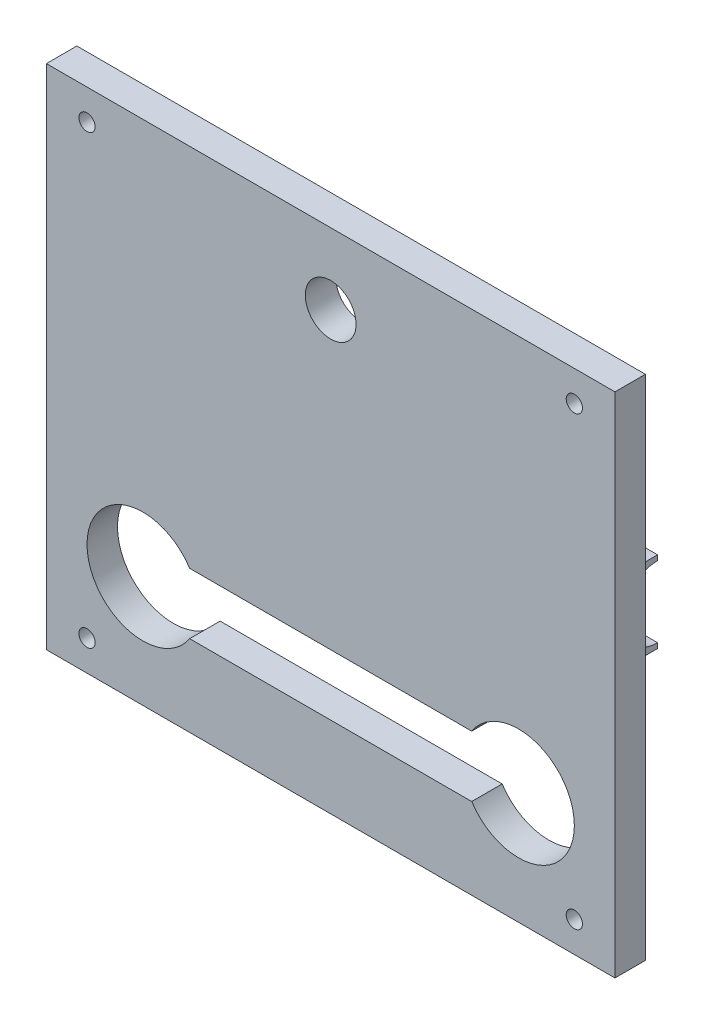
ISO-10303-21;
HEADER;
FILE_DESCRIPTION(('STEP AP214'),'2;1');
FILE_NAME('part.step','',(''),(''),'','','');
FILE_SCHEMA(('AUTOMOTIVE_DESIGN { 1 0 10303 214 1 1 1 1 }'));
ENDSEC;
DATA;
#1=APPLICATION_CONTEXT('core data for automotive mechanical design processes');
#2=APPLICATION_PROTOCOL_DEFINITION('international standard','automotive_design',2000,#1);
#3=PRODUCT_CONTEXT('',#1,'mechanical');
#4=PRODUCT('Part','Part','',(#3));
#5=PRODUCT_RELATED_PRODUCT_CATEGORY('part','',(#4));
#6=PRODUCT_DEFINITION_FORMATION('','',#4);
#7=PRODUCT_DEFINITION_CONTEXT('part definition',#1,'design');
#8=PRODUCT_DEFINITION('design','',#6,#7);
#9=PRODUCT_DEFINITION_SHAPE('','',#8);
#10=(LENGTH_UNIT() NAMED_UNIT(*) SI_UNIT(.MILLI.,.METRE.));
#11=(NAMED_UNIT(*) PLANE_ANGLE_UNIT() SI_UNIT($,.RADIAN.));
#12=(NAMED_UNIT(*) SI_UNIT($,.STERADIAN.) SOLID_ANGLE_UNIT());
#13=UNCERTAINTY_MEASURE_WITH_UNIT(LENGTH_MEASURE(1.E-05),#10,'distance_accuracy_value','');
#14=(GEOMETRIC_REPRESENTATION_CONTEXT(3) GLOBAL_UNCERTAINTY_ASSIGNED_CONTEXT((#13)) GLOBAL_UNIT_ASSIGNED_CONTEXT((#10,
#11,#12)) REPRESENTATION_CONTEXT('',''));
#15=CARTESIAN_POINT('',(0.,0.,0.));
#16=DIRECTION('',(0.,0.,1.));
#17=DIRECTION('',(1.,0.,0.));
#18=AXIS2_PLACEMENT_3D('',#15,#16,#17);
#19=CARTESIAN_POINT('',(0.,0.,-31.));
#20=DIRECTION('',(0.,0.,1.));
#21=DIRECTION('',(1.,0.,0.));
#22=AXIS2_PLACEMENT_3D('',#19,#20,#21);
#23=PLANE('',#22);
#24=DIRECTION('',(0.,-1.,0.));
#25=VECTOR('',#24,1.);
#26=CARTESIAN_POINT('',(25.,0.,-31.));
#27=LINE('',#26,#25);
#28=CARTESIAN_POINT('',(25.,-142.5,-31.));
#29=VERTEX_POINT('',#28);
#30=CARTESIAN_POINT('',(25.,-145.,-31.));
#31=VERTEX_POINT('',#30);
#32=EDGE_CURVE('E143',#29,#31,#27,.T.);
#33=ORIENTED_EDGE('',*,*,#32,.F.);
#34=DIRECTION('',(1.,0.,0.));
#35=VECTOR('',#34,1.);
#36=CARTESIAN_POINT('',(0.,-142.5,-31.));
#37=LINE('',#36,#35);
#38=CARTESIAN_POINT('',(255.,-142.5,-31.));
#39=VERTEX_POINT('',#38);
#40=EDGE_CURVE('E11',#29,#39,#37,.T.);
#41=ORIENTED_EDGE('',*,*,#40,.T.);
#42=DIRECTION('',(0.,1.,0.));
#43=VECTOR('',#42,1.);
#44=CARTESIAN_POINT('',(255.,0.,-31.));
#45=LINE('',#44,#43);
#46=CARTESIAN_POINT('',(255.,-145.,-31.));
#47=VERTEX_POINT('',#46);
#48=EDGE_CURVE('E141',#47,#39,#45,.T.);
#49=ORIENTED_EDGE('',*,*,#48,.F.);
#50=DIRECTION('',(1.,0.,0.));
#51=VECTOR('',#50,1.);
#52=CARTESIAN_POINT('',(0.,-145.,-31.));
#53=LINE('',#52,#51);
#54=EDGE_CURVE('E152',#31,#47,#53,.T.);
#55=ORIENTED_EDGE('',*,*,#54,.F.);
#56=EDGE_LOOP('',(#33,#41,#49,#55));
#57=FACE_BOUND('',#56,.T.);
#58=ADVANCED_FACE('F33',(#57),#23,.F.);
#59=CARTESIAN_POINT('',(0.,0.,15.));
#60=DIRECTION('',(1.,0.,0.));
#61=DIRECTION('',(0.,1.,0.));
#62=AXIS2_PLACEMENT_3D('',#59,#60,#61);
#63=PLANE('',#62);
#64=DIRECTION('',(0.,-1.,0.));
#65=VECTOR('',#64,1.);
#66=CARTESIAN_POINT('',(0.,0.,0.));
#67=LINE('',#66,#65);
#68=CARTESIAN_POINT('',(0.,0.,0.));
#69=VERTEX_POINT('',#68);
#70=CARTESIAN_POINT('',(0.,-250.,0.));
#71=VERTEX_POINT('',#70);
#72=EDGE_CURVE('E193',#69,#71,#67,.T.);
#73=ORIENTED_EDGE('',*,*,#72,.T.);
#74=DIRECTION('',(0.,0.,-1.));
#75=VECTOR('',#74,1.);
#76=CARTESIAN_POINT('',(0.,-250.,15.));
#77=LINE('',#76,#75);
#78=CARTESIAN_POINT('',(0.,-250.,15.));
#79=VERTEX_POINT('',#78);
#80=EDGE_CURVE('E226',#79,#71,#77,.T.);
#81=ORIENTED_EDGE('',*,*,#80,.F.);
#82=DIRECTION('',(0.,-1.,0.));
#83=VECTOR('',#82,1.);
#84=CARTESIAN_POINT('',(0.,0.,15.));
#85=LINE('',#84,#83);
#86=CARTESIAN_POINT('',(0.,0.,15.));
#87=VERTEX_POINT('',#86);
#88=EDGE_CURVE('E200',#87,#79,#85,.T.);
#89=ORIENTED_EDGE('',*,*,#88,.F.);
#90=DIRECTION('',(0.,0.,-1.));
#91=VECTOR('',#90,1.);
#92=CARTESIAN_POINT('',(0.,0.,15.));
#93=LINE('',#92,#91);
#94=EDGE_CURVE('E210',#87,#69,#93,.T.);
#95=ORIENTED_EDGE('',*,*,#94,.T.);
#96=EDGE_LOOP('',(#73,#81,#89,#95));
#97=FACE_BOUND('',#96,.T.);
#98=ADVANCED_FACE('F35',(#97),#63,.F.);
#99=CARTESIAN_POINT('',(0.,-250.,15.));
#100=DIRECTION('',(0.,1.,0.));
#101=DIRECTION('',(0.,0.,1.));
#102=AXIS2_PLACEMENT_3D('',#99,#100,#101);
#103=PLANE('',#102);
#104=DIRECTION('',(1.,0.,0.));
#105=VECTOR('',#104,1.);
#106=CARTESIAN_POINT('',(0.,-250.,0.));
#107=LINE('',#106,#105);
#108=CARTESIAN_POINT('',(280.,-250.,0.));
#109=VERTEX_POINT('',#108);
#110=EDGE_CURVE('E213',#71,#109,#107,.T.);
#111=ORIENTED_EDGE('',*,*,#110,.T.);
#112=DIRECTION('',(0.,0.,-1.));
#113=VECTOR('',#112,1.);
#114=CARTESIAN_POINT('',(280.,-250.,15.));
#115=LINE('',#114,#113);
#116=CARTESIAN_POINT('',(280.,-250.,15.));
#117=VERTEX_POINT('',#116);
#118=EDGE_CURVE('E223',#117,#109,#115,.T.);
#119=ORIENTED_EDGE('',*,*,#118,.F.);
#120=DIRECTION('',(1.,0.,0.));
#121=VECTOR('',#120,1.);
#122=CARTESIAN_POINT('',(0.,-250.,15.));
#123=LINE('',#122,#121);
#124=EDGE_CURVE('E203',#79,#117,#123,.T.);
#125=ORIENTED_EDGE('',*,*,#124,.F.);
#126=ORIENTED_EDGE('',*,*,#80,.T.);
#127=EDGE_LOOP('',(#111,#119,#125,#126));
#128=FACE_BOUND('',#127,.T.);
#129=ADVANCED_FACE('F320',(#128),#103,.F.);
#130=CARTESIAN_POINT('',(280.,0.,15.));
#131=DIRECTION('',(-1.,0.,0.));
#132=DIRECTION('',(0.,-1.,0.));
#133=AXIS2_PLACEMENT_3D('',#130,#131,#132);
#134=PLANE('',#133);
#135=DIRECTION('',(0.,1.,0.));
#136=VECTOR('',#135,1.);
#137=CARTESIAN_POINT('',(280.,0.,0.));
#138=LINE('',#137,#136);
#139=CARTESIAN_POINT('',(280.,0.,0.));
#140=VERTEX_POINT('',#139);
#141=EDGE_CURVE('E215',#109,#140,#138,.T.);
#142=ORIENTED_EDGE('',*,*,#141,.T.);
#143=DIRECTION('',(0.,0.,-1.));
#144=VECTOR('',#143,1.);
#145=CARTESIAN_POINT('',(280.,0.,15.));
#146=LINE('',#145,#144);
#147=CARTESIAN_POINT('',(280.,0.,15.));
#148=VERTEX_POINT('',#147);
#149=EDGE_CURVE('E220',#148,#140,#146,.T.);
#150=ORIENTED_EDGE('',*,*,#149,.F.);
#151=DIRECTION('',(0.,1.,0.));
#152=VECTOR('',#151,1.);
#153=CARTESIAN_POINT('',(280.,0.,15.));
#154=LINE('',#153,#152);
#155=EDGE_CURVE('E206',#117,#148,#154,.T.);
#156=ORIENTED_EDGE('',*,*,#155,.F.);
#157=ORIENTED_EDGE('',*,*,#118,.T.);
#158=EDGE_LOOP('',(#142,#150,#156,#157));
#159=FACE_BOUND('',#158,.T.);
#160=ADVANCED_FACE('F325',(#159),#134,.F.);
#161=CARTESIAN_POINT('',(0.,0.,15.));
#162=DIRECTION('',(0.,-1.,0.));
#163=DIRECTION('',(0.,0.,-1.));
#164=AXIS2_PLACEMENT_3D('',#161,#162,#163);
#165=PLANE('',#164);
#166=DIRECTION('',(-1.,0.,0.));
#167=VECTOR('',#166,1.);
#168=CARTESIAN_POINT('',(0.,0.,0.));
#169=LINE('',#168,#167);
#170=EDGE_CURVE('E204',#140,#69,#169,.T.);
#171=ORIENTED_EDGE('',*,*,#170,.T.);
#172=ORIENTED_EDGE('',*,*,#94,.F.);
#173=DIRECTION('',(-1.,0.,0.));
#174=VECTOR('',#173,1.);
#175=CARTESIAN_POINT('',(0.,0.,15.));
#176=LINE('',#175,#174);
#177=EDGE_CURVE('E208',#148,#87,#176,.T.);
#178=ORIENTED_EDGE('',*,*,#177,.F.);
#179=ORIENTED_EDGE('',*,*,#149,.T.);
#180=EDGE_LOOP('',(#171,#172,#178,#179));
#181=FACE_BOUND('',#180,.T.);
#182=ADVANCED_FACE('F301',(#181),#165,.F.);
#183=CARTESIAN_POINT('',(0.,0.,15.));
#184=DIRECTION('',(0.,0.,1.));
#185=DIRECTION('',(1.,0.,0.));
#186=AXIS2_PLACEMENT_3D('',#183,#184,#185);
#187=PLANE('',#186);
#188=CARTESIAN_POINT('',(260.,-235.,15.));
#189=DIRECTION('',(0.,0.,1.));
#190=DIRECTION('',(1.,0.,0.));
#191=AXIS2_PLACEMENT_3D('',#188,#189,#190);
#192=CIRCLE('',#191,3.99999999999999);
#193=CARTESIAN_POINT('',(264.,-235.,15.));
#194=VERTEX_POINT('',#193);
#195=EDGE_CURVE('E276',#194,#194,#192,.T.);
#196=ORIENTED_EDGE('',*,*,#195,.F.);
#197=EDGE_LOOP('',(#196));
#198=FACE_BOUND('',#197,.T.);
#199=CARTESIAN_POINT('',(20.,-15.,15.));
#200=DIRECTION('',(0.,0.,1.));
#201=DIRECTION('',(1.,0.,0.));
#202=AXIS2_PLACEMENT_3D('',#199,#200,#201);
#203=CIRCLE('',#202,4.);
#204=CARTESIAN_POINT('',(24.,-15.,15.));
#205=VERTEX_POINT('',#204);
#206=EDGE_CURVE('E269',#205,#205,#203,.T.);
#207=ORIENTED_EDGE('',*,*,#206,.F.);
#208=EDGE_LOOP('',(#207));
#209=FACE_BOUND('',#208,.T.);
#210=CARTESIAN_POINT('',(260.,-15.,15.));
#211=DIRECTION('',(0.,0.,1.));
#212=DIRECTION('',(1.,0.,0.));
#213=AXIS2_PLACEMENT_3D('',#210,#211,#212);
#214=CIRCLE('',#213,3.99999999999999);
#215=CARTESIAN_POINT('',(264.,-15.,15.));
#216=VERTEX_POINT('',#215);
#217=EDGE_CURVE('E281',#216,#216,#214,.T.);
#218=ORIENTED_EDGE('',*,*,#217,.F.);
#219=EDGE_LOOP('',(#218));
#220=FACE_BOUND('',#219,.T.);
#221=CARTESIAN_POINT('',(20.,-235.,15.));
#222=DIRECTION('',(0.,0.,1.));
#223=DIRECTION('',(1.,0.,0.));
#224=AXIS2_PLACEMENT_3D('',#221,#222,#223);
#225=CIRCLE('',#224,4.);
#226=CARTESIAN_POINT('',(24.,-235.,15.));
#227=VERTEX_POINT('',#226);
#228=EDGE_CURVE('E263',#227,#227,#225,.T.);
#229=ORIENTED_EDGE('',*,*,#228,.F.);
#230=EDGE_LOOP('',(#229));
#231=FACE_BOUND('',#230,.T.);
#232=CARTESIAN_POINT('',(140.,-35.,15.));
#233=DIRECTION('',(0.,0.,1.));
#234=DIRECTION('',(1.,0.,0.));
#235=AXIS2_PLACEMENT_3D('',#232,#233,#234);
#236=CIRCLE('',#235,12.5);
#237=CARTESIAN_POINT('',(152.5,-35.,15.));
#238=VERTEX_POINT('',#237);
#239=EDGE_CURVE('E256',#238,#238,#236,.T.);
#240=ORIENTED_EDGE('',*,*,#239,.F.);
#241=EDGE_LOOP('',(#240));
#242=FACE_BOUND('',#241,.T.);
#243=CARTESIAN_POINT('',(232.5,-195.,15.));
#244=DIRECTION('',(0.,0.,1.));
#245=DIRECTION('',(1.,0.,0.));
#246=AXIS2_PLACEMENT_3D('',#243,#244,#245);
#247=CIRCLE('',#246,27.5);
#248=CARTESIAN_POINT('',(209.451138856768,-210.,15.));
#249=VERTEX_POINT('',#248);
#250=CARTESIAN_POINT('',(209.451138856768,-180.,15.));
#251=VERTEX_POINT('',#250);
#252=EDGE_CURVE('E162',#249,#251,#247,.T.);
#253=ORIENTED_EDGE('',*,*,#252,.F.);
#254=DIRECTION('',(1.,0.,0.));
#255=VECTOR('',#254,1.);
#256=CARTESIAN_POINT('',(70.5488611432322,-210.,15.));
#257=LINE('',#256,#255);
#258=CARTESIAN_POINT('',(70.5488611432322,-210.,15.));
#259=VERTEX_POINT('',#258);
#260=EDGE_CURVE('E172',#259,#249,#257,.T.);
#261=ORIENTED_EDGE('',*,*,#260,.F.);
#262=CARTESIAN_POINT('',(47.5,-195.,15.));
#263=DIRECTION('',(0.,0.,1.));
#264=DIRECTION('',(1.,0.,0.));
#265=AXIS2_PLACEMENT_3D('',#262,#263,#264);
#266=CIRCLE('',#265,27.5);
#267=CARTESIAN_POINT('',(70.5488611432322,-180.,15.));
#268=VERTEX_POINT('',#267);
#269=EDGE_CURVE('E186',#268,#259,#266,.T.);
#270=ORIENTED_EDGE('',*,*,#269,.F.);
#271=DIRECTION('',(-1.,0.,0.));
#272=VECTOR('',#271,1.);
#273=CARTESIAN_POINT('',(70.5488611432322,-180.,15.));
#274=LINE('',#273,#272);
#275=EDGE_CURVE('E183',#251,#268,#274,.T.);
#276=ORIENTED_EDGE('',*,*,#275,.F.);
#277=EDGE_LOOP('',(#253,#261,#270,#276));
#278=FACE_BOUND('',#277,.T.);
#279=ORIENTED_EDGE('',*,*,#88,.T.);
#280=ORIENTED_EDGE('',*,*,#124,.T.);
#281=ORIENTED_EDGE('',*,*,#155,.T.);
#282=ORIENTED_EDGE('',*,*,#177,.T.);
#283=EDGE_LOOP('',(#279,#280,#281,#282));
#284=FACE_BOUND('',#283,.T.);
#285=ADVANCED_FACE('F298',(#198,#209,#220,#231,#242,#278,#284),#187,.T.);
#286=CARTESIAN_POINT('',(0.,0.,0.));
#287=DIRECTION('',(0.,0.,1.));
#288=DIRECTION('',(1.,0.,0.));
#289=AXIS2_PLACEMENT_3D('',#286,#287,#288);
#290=PLANE('',#289);
#291=CARTESIAN_POINT('',(260.,-235.,0.));
#292=DIRECTION('',(0.,0.,1.));
#293=DIRECTION('',(1.,0.,0.));
#294=AXIS2_PLACEMENT_3D('',#291,#292,#293);
#295=CIRCLE('',#294,3.99999999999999);
#296=CARTESIAN_POINT('',(264.,-235.,0.));
#297=VERTEX_POINT('',#296);
#298=EDGE_CURVE('E266',#297,#297,#295,.T.);
#299=ORIENTED_EDGE('',*,*,#298,.T.);
#300=EDGE_LOOP('',(#299));
#301=FACE_BOUND('',#300,.T.);
#302=CARTESIAN_POINT('',(20.,-15.,0.));
#303=DIRECTION('',(0.,0.,1.));
#304=DIRECTION('',(1.,0.,0.));
#305=AXIS2_PLACEMENT_3D('',#302,#303,#304);
#306=CIRCLE('',#305,4.);
#307=CARTESIAN_POINT('',(24.,-15.,0.));
#308=VERTEX_POINT('',#307);
#309=EDGE_CURVE('E272',#308,#308,#306,.T.);
#310=ORIENTED_EDGE('',*,*,#309,.T.);
#311=EDGE_LOOP('',(#310));
#312=FACE_BOUND('',#311,.T.);
#313=CARTESIAN_POINT('',(260.,-15.,0.));
#314=DIRECTION('',(0.,0.,1.));
#315=DIRECTION('',(1.,0.,0.));
#316=AXIS2_PLACEMENT_3D('',#313,#314,#315);
#317=CIRCLE('',#316,3.99999999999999);
#318=CARTESIAN_POINT('',(264.,-15.,0.));
#319=VERTEX_POINT('',#318);
#320=EDGE_CURVE('E273',#319,#319,#317,.T.);
#321=ORIENTED_EDGE('',*,*,#320,.T.);
#322=EDGE_LOOP('',(#321));
#323=FACE_BOUND('',#322,.T.);
#324=CARTESIAN_POINT('',(20.,-235.,0.));
#325=DIRECTION('',(0.,0.,1.));
#326=DIRECTION('',(1.,0.,0.));
#327=AXIS2_PLACEMENT_3D('',#324,#325,#326);
#328=CIRCLE('',#327,4.);
#329=CARTESIAN_POINT('',(24.,-235.,0.));
#330=VERTEX_POINT('',#329);
#331=EDGE_CURVE('E261',#330,#330,#328,.T.);
#332=ORIENTED_EDGE('',*,*,#331,.T.);
#333=EDGE_LOOP('',(#332));
#334=FACE_BOUND('',#333,.T.);
#335=CARTESIAN_POINT('',(140.,-35.,0.));
#336=DIRECTION('',(0.,0.,1.));
#337=DIRECTION('',(1.,0.,0.));
#338=AXIS2_PLACEMENT_3D('',#335,#336,#337);
#339=CIRCLE('',#338,12.5);
#340=CARTESIAN_POINT('',(152.5,-35.,0.));
#341=VERTEX_POINT('',#340);
#342=EDGE_CURVE('E254',#341,#341,#339,.T.);
#343=ORIENTED_EDGE('',*,*,#342,.T.);
#344=EDGE_LOOP('',(#343));
#345=FACE_BOUND('',#344,.T.);
#346=DIRECTION('',(0.,-1.,0.));
#347=VECTOR('',#346,1.);
#348=CARTESIAN_POINT('',(25.,0.,0.));
#349=LINE('',#348,#347);
#350=CARTESIAN_POINT('',(25.,-105.,0.));
#351=VERTEX_POINT('',#350);
#352=CARTESIAN_POINT('',(25.,-145.,0.));
#353=VERTEX_POINT('',#352);
#354=EDGE_CURVE('E235',#351,#353,#349,.T.);
#355=ORIENTED_EDGE('',*,*,#354,.T.);
#356=DIRECTION('',(1.,0.,0.));
#357=VECTOR('',#356,1.);
#358=CARTESIAN_POINT('',(0.,-145.,0.));
#359=LINE('',#358,#357);
#360=CARTESIAN_POINT('',(255.,-145.,0.));
#361=VERTEX_POINT('',#360);
#362=EDGE_CURVE('E238',#353,#361,#359,.T.);
#363=ORIENTED_EDGE('',*,*,#362,.T.);
#364=DIRECTION('',(0.,1.,0.));
#365=VECTOR('',#364,1.);
#366=CARTESIAN_POINT('',(255.,0.,0.));
#367=LINE('',#366,#365);
#368=CARTESIAN_POINT('',(255.,-105.,0.));
#369=VERTEX_POINT('',#368);
#370=EDGE_CURVE('E229',#361,#369,#367,.T.);
#371=ORIENTED_EDGE('',*,*,#370,.T.);
#372=DIRECTION('',(-1.,0.,0.));
#373=VECTOR('',#372,1.);
#374=CARTESIAN_POINT('',(0.,-105.,0.));
#375=LINE('',#374,#373);
#376=EDGE_CURVE('E232',#369,#351,#375,.T.);
#377=ORIENTED_EDGE('',*,*,#376,.T.);
#378=EDGE_LOOP('',(#355,#363,#371,#377));
#379=FACE_BOUND('',#378,.T.);
#380=DIRECTION('',(1.,0.,0.));
#381=VECTOR('',#380,1.);
#382=CARTESIAN_POINT('',(70.5488611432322,-210.,0.));
#383=LINE('',#382,#381);
#384=CARTESIAN_POINT('',(70.5488611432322,-210.,0.));
#385=VERTEX_POINT('',#384);
#386=CARTESIAN_POINT('',(209.451138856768,-210.,0.));
#387=VERTEX_POINT('',#386);
#388=EDGE_CURVE('E178',#385,#387,#383,.T.);
#389=ORIENTED_EDGE('',*,*,#388,.T.);
#390=CARTESIAN_POINT('',(232.5,-195.,0.));
#391=DIRECTION('',(0.,0.,1.));
#392=DIRECTION('',(1.,0.,0.));
#393=AXIS2_PLACEMENT_3D('',#390,#391,#392);
#394=CIRCLE('',#393,27.5);
#395=CARTESIAN_POINT('',(209.451138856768,-180.,0.));
#396=VERTEX_POINT('',#395);
#397=EDGE_CURVE('E168',#387,#396,#394,.T.);
#398=ORIENTED_EDGE('',*,*,#397,.T.);
#399=DIRECTION('',(-1.,0.,0.));
#400=VECTOR('',#399,1.);
#401=CARTESIAN_POINT('',(70.5488611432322,-180.,0.));
#402=LINE('',#401,#400);
#403=CARTESIAN_POINT('',(70.5488611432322,-180.,0.));
#404=VERTEX_POINT('',#403);
#405=EDGE_CURVE('E171',#396,#404,#402,.T.);
#406=ORIENTED_EDGE('',*,*,#405,.T.);
#407=CARTESIAN_POINT('',(47.5,-195.,0.));
#408=DIRECTION('',(0.,0.,1.));
#409=DIRECTION('',(1.,0.,0.));
#410=AXIS2_PLACEMENT_3D('',#407,#408,#409);
#411=CIRCLE('',#410,27.5);
#412=EDGE_CURVE('E175',#404,#385,#411,.T.);
#413=ORIENTED_EDGE('',*,*,#412,.T.);
#414=EDGE_LOOP('',(#389,#398,#406,#413));
#415=FACE_BOUND('',#414,.T.);
#416=ORIENTED_EDGE('',*,*,#72,.F.);
#417=ORIENTED_EDGE('',*,*,#170,.F.);
#418=ORIENTED_EDGE('',*,*,#141,.F.);
#419=ORIENTED_EDGE('',*,*,#110,.F.);
#420=EDGE_LOOP('',(#416,#417,#418,#419));
#421=FACE_BOUND('',#420,.T.);
#422=ADVANCED_FACE('F249',(#301,#312,#323,#334,#345,#379,#415,#421),#290,.F.);
#423=CARTESIAN_POINT('',(232.5,-195.,0.));
#424=DIRECTION('',(0.,0.,1.));
#425=DIRECTION('',(1.,0.,0.));
#426=AXIS2_PLACEMENT_3D('',#423,#424,#425);
#427=CYLINDRICAL_SURFACE('',#426,27.5);
#428=ORIENTED_EDGE('',*,*,#252,.T.);
#429=DIRECTION('',(0.,0.,1.));
#430=VECTOR('',#429,1.);
#431=CARTESIAN_POINT('',(209.451138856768,-180.,0.));
#432=LINE('',#431,#430);
#433=EDGE_CURVE('E181',#396,#251,#432,.T.);
#434=ORIENTED_EDGE('',*,*,#433,.F.);
#435=ORIENTED_EDGE('',*,*,#397,.F.);
#436=DIRECTION('',(0.,0.,1.));
#437=VECTOR('',#436,1.);
#438=CARTESIAN_POINT('',(209.451138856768,-210.,0.));
#439=LINE('',#438,#437);
#440=EDGE_CURVE('E191',#387,#249,#439,.T.);
#441=ORIENTED_EDGE('',*,*,#440,.T.);
#442=EDGE_LOOP('',(#428,#434,#435,#441));
#443=FACE_BOUND('',#442,.T.);
#444=ADVANCED_FACE('F330',(#443),#427,.F.);
#445=CARTESIAN_POINT('',(70.5488611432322,-210.,0.));
#446=DIRECTION('',(0.,-1.,0.));
#447=DIRECTION('',(1.,0.,0.));
#448=AXIS2_PLACEMENT_3D('',#445,#446,#447);
#449=PLANE('',#448);
#450=ORIENTED_EDGE('',*,*,#260,.T.);
#451=ORIENTED_EDGE('',*,*,#440,.F.);
#452=ORIENTED_EDGE('',*,*,#388,.F.);
#453=DIRECTION('',(0.,0.,1.));
#454=VECTOR('',#453,1.);
#455=CARTESIAN_POINT('',(70.5488611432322,-210.,0.));
#456=LINE('',#455,#454);
#457=EDGE_CURVE('E194',#385,#259,#456,.T.);
#458=ORIENTED_EDGE('',*,*,#457,.T.);
#459=EDGE_LOOP('',(#450,#451,#452,#458));
#460=FACE_BOUND('',#459,.T.);
#461=ADVANCED_FACE('F336',(#460),#449,.F.);
#462=CARTESIAN_POINT('',(47.5,-195.,0.));
#463=DIRECTION('',(0.,0.,1.));
#464=DIRECTION('',(1.,0.,0.));
#465=AXIS2_PLACEMENT_3D('',#462,#463,#464);
#466=CYLINDRICAL_SURFACE('',#465,27.5);
#467=ORIENTED_EDGE('',*,*,#269,.T.);
#468=ORIENTED_EDGE('',*,*,#457,.F.);
#469=ORIENTED_EDGE('',*,*,#412,.F.);
#470=DIRECTION('',(0.,0.,1.));
#471=VECTOR('',#470,1.);
#472=CARTESIAN_POINT('',(70.5488611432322,-180.,0.));
#473=LINE('',#472,#471);
#474=EDGE_CURVE('E196',#404,#268,#473,.T.);
#475=ORIENTED_EDGE('',*,*,#474,.T.);
#476=EDGE_LOOP('',(#467,#468,#469,#475));
#477=FACE_BOUND('',#476,.T.);
#478=ADVANCED_FACE('F366',(#477),#466,.F.);
#479=CARTESIAN_POINT('',(70.5488611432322,-180.,0.));
#480=DIRECTION('',(0.,1.,0.));
#481=DIRECTION('',(-1.,0.,0.));
#482=AXIS2_PLACEMENT_3D('',#479,#480,#481);
#483=PLANE('',#482);
#484=ORIENTED_EDGE('',*,*,#275,.T.);
#485=ORIENTED_EDGE('',*,*,#474,.F.);
#486=ORIENTED_EDGE('',*,*,#405,.F.);
#487=ORIENTED_EDGE('',*,*,#433,.T.);
#488=EDGE_LOOP('',(#484,#485,#486,#487));
#489=FACE_BOUND('',#488,.T.);
#490=ADVANCED_FACE('F363',(#489),#483,.F.);
#491=CARTESIAN_POINT('',(0.,-145.,-31.));
#492=DIRECTION('',(0.,-1.,0.));
#493=DIRECTION('',(0.,0.,-1.));
#494=AXIS2_PLACEMENT_3D('',#491,#492,#493);
#495=PLANE('',#494);
#496=ORIENTED_EDGE('',*,*,#362,.F.);
#497=DIRECTION('',(0.,0.,1.));
#498=VECTOR('',#497,1.);
#499=CARTESIAN_POINT('',(25.,-145.,-31.));
#500=LINE('',#499,#498);
#501=EDGE_CURVE('E159',#31,#353,#500,.T.);
#502=ORIENTED_EDGE('',*,*,#501,.F.);
#503=ORIENTED_EDGE('',*,*,#54,.T.);
#504=DIRECTION('',(0.,0.,1.));
#505=VECTOR('',#504,1.);
#506=CARTESIAN_POINT('',(255.,-145.,-31.));
#507=LINE('',#506,#505);
#508=EDGE_CURVE('E146',#47,#361,#507,.T.);
#509=ORIENTED_EDGE('',*,*,#508,.T.);
#510=EDGE_LOOP('',(#496,#502,#503,#509));
#511=FACE_BOUND('',#510,.T.);
#512=ADVANCED_FACE('F252',(#511),#495,.T.);
#513=CARTESIAN_POINT('',(25.,0.,-31.));
#514=DIRECTION('',(-1.,0.,0.));
#515=DIRECTION('',(0.,-1.,0.));
#516=AXIS2_PLACEMENT_3D('',#513,#514,#515);
#517=PLANE('',#516);
#518=CARTESIAN_POINT('',(25.,-125.,-31.));
#519=DIRECTION('',(-1.,0.,0.));
#520=DIRECTION('',(0.,-1.,0.));
#521=AXIS2_PLACEMENT_3D('',#518,#519,#520);
#522=CIRCLE('',#521,17.5);
#523=CARTESIAN_POINT('',(25.,-107.5,-31.));
#524=VERTEX_POINT('',#523);
#525=EDGE_CURVE('E48',#29,#524,#522,.T.);
#526=ORIENTED_EDGE('',*,*,#525,.F.);
#527=ORIENTED_EDGE('',*,*,#32,.T.);
#528=ORIENTED_EDGE('',*,*,#501,.T.);
#529=ORIENTED_EDGE('',*,*,#354,.F.);
#530=DIRECTION('',(0.,0.,1.));
#531=VECTOR('',#530,1.);
#532=CARTESIAN_POINT('',(25.,-105.,-31.));
#533=LINE('',#532,#531);
#534=CARTESIAN_POINT('',(25.,-105.,-31.));
#535=VERTEX_POINT('',#534);
#536=EDGE_CURVE('E163',#535,#351,#533,.T.);
#537=ORIENTED_EDGE('',*,*,#536,.F.);
#538=EDGE_CURVE('E156',#535,#524,#27,.T.);
#539=ORIENTED_EDGE('',*,*,#538,.T.);
#540=EDGE_LOOP('',(#526,#527,#528,#529,#537,#539));
#541=FACE_BOUND('',#540,.T.);
#542=ADVANCED_FACE('F245',(#541),#517,.T.);
#543=CARTESIAN_POINT('',(0.,-105.,-31.));
#544=DIRECTION('',(0.,1.,0.));
#545=DIRECTION('',(-1.,0.,0.));
#546=AXIS2_PLACEMENT_3D('',#543,#544,#545);
#547=PLANE('',#546);
#548=ORIENTED_EDGE('',*,*,#376,.F.);
#549=DIRECTION('',(0.,0.,1.));
#550=VECTOR('',#549,1.);
#551=CARTESIAN_POINT('',(255.,-105.,-31.));
#552=LINE('',#551,#550);
#553=CARTESIAN_POINT('',(255.,-105.,-31.));
#554=VERTEX_POINT('',#553);
#555=EDGE_CURVE('E56',#554,#369,#552,.T.);
#556=ORIENTED_EDGE('',*,*,#555,.F.);
#557=DIRECTION('',(-1.,0.,0.));
#558=VECTOR('',#557,1.);
#559=CARTESIAN_POINT('',(0.,-105.,-31.));
#560=LINE('',#559,#558);
#561=EDGE_CURVE('E147',#554,#535,#560,.T.);
#562=ORIENTED_EDGE('',*,*,#561,.T.);
#563=ORIENTED_EDGE('',*,*,#536,.T.);
#564=EDGE_LOOP('',(#548,#556,#562,#563));
#565=FACE_BOUND('',#564,.T.);
#566=ADVANCED_FACE('F247',(#565),#547,.T.);
#567=CARTESIAN_POINT('',(255.,0.,-31.));
#568=DIRECTION('',(1.,0.,0.));
#569=DIRECTION('',(0.,0.,-1.));
#570=AXIS2_PLACEMENT_3D('',#567,#568,#569);
#571=PLANE('',#570);
#572=CARTESIAN_POINT('',(255.,-125.,-31.));
#573=DIRECTION('',(1.,0.,0.));
#574=DIRECTION('',(0.,0.,1.));
#575=AXIS2_PLACEMENT_3D('',#572,#573,#574);
#576=CIRCLE('',#575,17.5);
#577=CARTESIAN_POINT('',(255.,-107.5,-31.));
#578=VERTEX_POINT('',#577);
#579=EDGE_CURVE('E132',#578,#39,#576,.T.);
#580=ORIENTED_EDGE('',*,*,#579,.F.);
#581=EDGE_CURVE('E148',#578,#554,#45,.T.);
#582=ORIENTED_EDGE('',*,*,#581,.T.);
#583=ORIENTED_EDGE('',*,*,#555,.T.);
#584=ORIENTED_EDGE('',*,*,#370,.F.);
#585=ORIENTED_EDGE('',*,*,#508,.F.);
#586=ORIENTED_EDGE('',*,*,#48,.T.);
#587=EDGE_LOOP('',(#580,#582,#583,#584,#585,#586));
#588=FACE_BOUND('',#587,.T.);
#589=ADVANCED_FACE('F144',(#588),#571,.T.);
#590=ORIENTED_EDGE('',*,*,#581,.F.);
#591=DIRECTION('',(1.,0.,0.));
#592=VECTOR('',#591,1.);
#593=CARTESIAN_POINT('',(0.,-107.5,-31.));
#594=LINE('',#593,#592);
#595=EDGE_CURVE('E41',#578,#524,#594,.F.);
#596=ORIENTED_EDGE('',*,*,#595,.T.);
#597=ORIENTED_EDGE('',*,*,#538,.F.);
#598=ORIENTED_EDGE('',*,*,#561,.F.);
#599=EDGE_LOOP('',(#590,#596,#597,#598));
#600=FACE_BOUND('',#599,.T.);
#601=ADVANCED_FACE('F242',(#600),#23,.F.);
#602=CARTESIAN_POINT('',(140.,-35.,0.));
#603=DIRECTION('',(0.,0.,1.));
#604=DIRECTION('',(1.,0.,0.));
#605=AXIS2_PLACEMENT_3D('',#602,#603,#604);
#606=CYLINDRICAL_SURFACE('',#605,12.5);
#607=ORIENTED_EDGE('',*,*,#342,.F.);
#608=EDGE_LOOP('',(#607));
#609=FACE_BOUND('',#608,.T.);
#610=ORIENTED_EDGE('',*,*,#239,.T.);
#611=EDGE_LOOP('',(#610));
#612=FACE_BOUND('',#611,.T.);
#613=ADVANCED_FACE('F349',(#609,#612),#606,.F.);
#614=CARTESIAN_POINT('',(20.,-235.,0.));
#615=DIRECTION('',(0.,0.,1.));
#616=DIRECTION('',(1.,0.,0.));
#617=AXIS2_PLACEMENT_3D('',#614,#615,#616);
#618=CYLINDRICAL_SURFACE('',#617,4.);
#619=ORIENTED_EDGE('',*,*,#331,.F.);
#620=EDGE_LOOP('',(#619));
#621=FACE_BOUND('',#620,.T.);
#622=ORIENTED_EDGE('',*,*,#228,.T.);
#623=EDGE_LOOP('',(#622));
#624=FACE_BOUND('',#623,.T.);
#625=ADVANCED_FACE('F294',(#621,#624),#618,.F.);
#626=CARTESIAN_POINT('',(260.,-15.,0.));
#627=DIRECTION('',(0.,0.,1.));
#628=DIRECTION('',(1.,0.,0.));
#629=AXIS2_PLACEMENT_3D('',#626,#627,#628);
#630=CYLINDRICAL_SURFACE('',#629,3.99999999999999);
#631=ORIENTED_EDGE('',*,*,#320,.F.);
#632=EDGE_LOOP('',(#631));
#633=FACE_BOUND('',#632,.T.);
#634=ORIENTED_EDGE('',*,*,#217,.T.);
#635=EDGE_LOOP('',(#634));
#636=FACE_BOUND('',#635,.T.);
#637=ADVANCED_FACE('F290',(#633,#636),#630,.F.);
#638=CARTESIAN_POINT('',(20.,-15.,0.));
#639=DIRECTION('',(0.,0.,1.));
#640=DIRECTION('',(1.,0.,0.));
#641=AXIS2_PLACEMENT_3D('',#638,#639,#640);
#642=CYLINDRICAL_SURFACE('',#641,4.);
#643=ORIENTED_EDGE('',*,*,#309,.F.);
#644=EDGE_LOOP('',(#643));
#645=FACE_BOUND('',#644,.T.);
#646=ORIENTED_EDGE('',*,*,#206,.T.);
#647=EDGE_LOOP('',(#646));
#648=FACE_BOUND('',#647,.T.);
#649=ADVANCED_FACE('F293',(#645,#648),#642,.F.);
#650=CARTESIAN_POINT('',(260.,-235.,0.));
#651=DIRECTION('',(0.,0.,1.));
#652=DIRECTION('',(1.,0.,0.));
#653=AXIS2_PLACEMENT_3D('',#650,#651,#652);
#654=CYLINDRICAL_SURFACE('',#653,3.99999999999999);
#655=ORIENTED_EDGE('',*,*,#298,.F.);
#656=EDGE_LOOP('',(#655));
#657=FACE_BOUND('',#656,.T.);
#658=ORIENTED_EDGE('',*,*,#195,.T.);
#659=EDGE_LOOP('',(#658));
#660=FACE_BOUND('',#659,.T.);
#661=ADVANCED_FACE('F440',(#657,#660),#654,.F.);
#662=CARTESIAN_POINT('',(0.,-125.,-31.));
#663=DIRECTION('',(1.,0.,0.));
#664=DIRECTION('',(0.,0.,-1.));
#665=AXIS2_PLACEMENT_3D('',#662,#663,#664);
#666=CYLINDRICAL_SURFACE('',#665,17.5);
#667=ORIENTED_EDGE('',*,*,#525,.T.);
#668=ORIENTED_EDGE('',*,*,#595,.F.);
#669=ORIENTED_EDGE('',*,*,#579,.T.);
#670=ORIENTED_EDGE('',*,*,#40,.F.);
#671=EDGE_LOOP('',(#667,#668,#669,#670));
#672=FACE_BOUND('',#671,.T.);
#673=ADVANCED_FACE('F133',(#672),#666,.F.);
#674=CLOSED_SHELL('',(#58,#98,#129,#160,#182,#285,#422,#444,#461,#478,#490,#512,#542,#566,#589,
#601,#613,#625,#637,#649,#661,#673));
#675=MANIFOLD_SOLID_BREP('B2',#674);
#676=ADVANCED_BREP_SHAPE_REPRESENTATION('',(#18,#675),#14);
#677=SHAPE_DEFINITION_REPRESENTATION(#9,#676);
ENDSEC;
END-ISO-10303-21;
